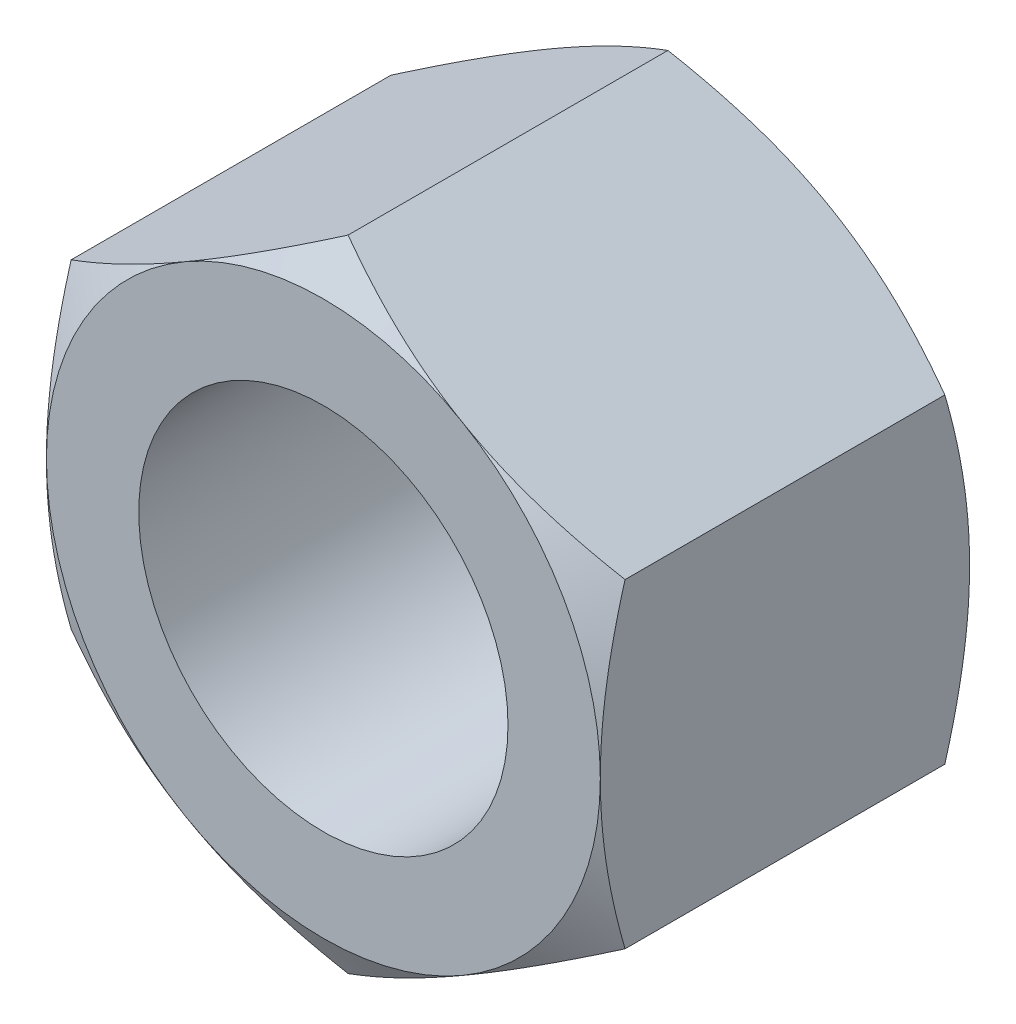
from build123d import *

# Parameters (mm, degrees)
BASE_EXTRUSION_DEPTH    = 12
ESQUISSE3_R             = 6
ENL_V_MAT_EXTRU_1_DEPTH = 19.248287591


with BuildPart() as part:
    # Esquisse1 → Base-Extrusion (new body)
    with BuildSketch(Plane.XY):
        Polygon((9, -5.196152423), (9, 5.196152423), (0, 10.392304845), (-9, 5.196152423), (-9, -5.196152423), (0, -10.392304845), align=None)
    extrude(amount=-BASE_EXTRUSION_DEPTH)

    # Esquisse2 → Enl_vement de mati_re-R_volution1 (revolve, cut)
    with BuildSketch(Plane(origin=(0, 0, 0), x_dir=(1, 0, 0), z_dir=(0, 1, 0)), mode=Mode.PRIVATE) as enl_vement_de_mati_re_r_volution1_sk:
        Polygon((-9, 0), (-20.392304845, 0), (-20.392304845, 12), (-9, 12), (-19.392304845, 6), align=None)
    revolve(enl_vement_de_mati_re_r_volution1_sk.sketch.rotate(Axis((0, 0, -12), (0, 0, 1)), 180), axis=Axis((0, 0, -12), (0, 0, 1)), mode=Mode.SUBTRACT)

    # Esquisse3 → Enl_v. mat.-Extru.1 (cut, through all)
    with BuildSketch(Plane.XY):
        Circle(ESQUISSE3_R)
    extrude(amount=-ENL_V_MAT_EXTRU_1_DEPTH, mode=Mode.SUBTRACT)


solid = part.part
